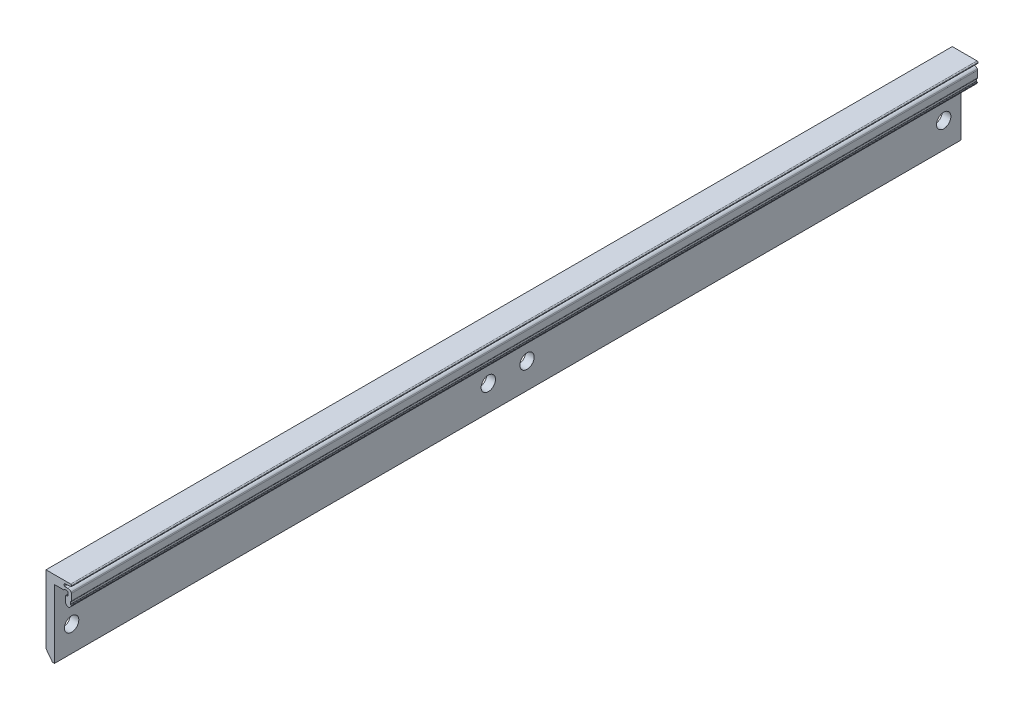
ISO-10303-21;
HEADER;
FILE_DESCRIPTION(('STEP AP214'),'2;1');
FILE_NAME('part.step','',(''),(''),'','','');
FILE_SCHEMA(('AUTOMOTIVE_DESIGN { 1 0 10303 214 1 1 1 1 }'));
ENDSEC;
DATA;
#1=APPLICATION_CONTEXT('core data for automotive mechanical design processes');
#2=APPLICATION_PROTOCOL_DEFINITION('international standard','automotive_design',2000,#1);
#3=PRODUCT_CONTEXT('',#1,'mechanical');
#4=PRODUCT('Part','Part','',(#3));
#5=PRODUCT_RELATED_PRODUCT_CATEGORY('part','',(#4));
#6=PRODUCT_DEFINITION_FORMATION('','',#4);
#7=PRODUCT_DEFINITION_CONTEXT('part definition',#1,'design');
#8=PRODUCT_DEFINITION('design','',#6,#7);
#9=PRODUCT_DEFINITION_SHAPE('','',#8);
#10=(LENGTH_UNIT() NAMED_UNIT(*) SI_UNIT(.MILLI.,.METRE.));
#11=(NAMED_UNIT(*) PLANE_ANGLE_UNIT() SI_UNIT($,.RADIAN.));
#12=(NAMED_UNIT(*) SI_UNIT($,.STERADIAN.) SOLID_ANGLE_UNIT());
#13=UNCERTAINTY_MEASURE_WITH_UNIT(LENGTH_MEASURE(1.E-05),#10,'distance_accuracy_value','');
#14=(GEOMETRIC_REPRESENTATION_CONTEXT(3) GLOBAL_UNCERTAINTY_ASSIGNED_CONTEXT((#13)) GLOBAL_UNIT_ASSIGNED_CONTEXT((#10,
#11,#12)) REPRESENTATION_CONTEXT('',''));
#15=CARTESIAN_POINT('',(0.,0.,0.));
#16=DIRECTION('',(0.,0.,1.));
#17=DIRECTION('',(1.,0.,0.));
#18=AXIS2_PLACEMENT_3D('',#15,#16,#17);
#19=CARTESIAN_POINT('',(2350.3840351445,-3290.10376988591,132.675));
#20=DIRECTION('',(0.,-1.,0.));
#21=DIRECTION('',(0.,0.,-1.));
#22=AXIS2_PLACEMENT_3D('',#19,#20,#21);
#23=PLANE('',#22);
#24=DIRECTION('',(-1.,0.,0.));
#25=VECTOR('',#24,1.);
#26=CARTESIAN_POINT('',(2350.3840351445,-3290.10376988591,-132.675));
#27=LINE('',#26,#25);
#28=CARTESIAN_POINT('',(2357.62403514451,-3290.10376988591,-132.675));
#29=VERTEX_POINT('',#28);
#30=CARTESIAN_POINT('',(2350.3840351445,-3290.10376988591,-132.675));
#31=VERTEX_POINT('',#30);
#32=EDGE_CURVE('E178',#29,#31,#27,.T.);
#33=ORIENTED_EDGE('',*,*,#32,.T.);
#34=DIRECTION('',(0.,0.,-1.));
#35=VECTOR('',#34,1.);
#36=CARTESIAN_POINT('',(2350.3840351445,-3290.10376988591,132.675));
#37=LINE('',#36,#35);
#38=CARTESIAN_POINT('',(2350.3840351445,-3290.10376988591,132.675));
#39=VERTEX_POINT('',#38);
#40=EDGE_CURVE('E11',#39,#31,#37,.T.);
#41=ORIENTED_EDGE('',*,*,#40,.F.);
#42=DIRECTION('',(-1.,0.,0.));
#43=VECTOR('',#42,1.);
#44=CARTESIAN_POINT('',(2355.38403514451,-3290.10376988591,132.675));
#45=LINE('',#44,#43);
#46=CARTESIAN_POINT('',(2357.62403514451,-3290.10376988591,132.675));
#47=VERTEX_POINT('',#46);
#48=EDGE_CURVE('E184',#47,#39,#45,.T.);
#49=ORIENTED_EDGE('',*,*,#48,.F.);
#50=DIRECTION('',(0.,0.,-1.));
#51=VECTOR('',#50,1.);
#52=CARTESIAN_POINT('',(2357.62403514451,-3290.10376988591,132.675));
#53=LINE('',#52,#51);
#54=EDGE_CURVE('E308',#47,#29,#53,.T.);
#55=ORIENTED_EDGE('',*,*,#54,.T.);
#56=EDGE_LOOP('',(#33,#41,#49,#55));
#57=FACE_BOUND('',#56,.T.);
#58=ADVANCED_FACE('F34',(#57),#23,.F.);
#59=CARTESIAN_POINT('',(2350.3840351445,-3292.60376988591,132.675));
#60=DIRECTION('',(1.,0.,0.));
#61=DIRECTION('',(0.,0.,-1.));
#62=AXIS2_PLACEMENT_3D('',#59,#60,#61);
#63=PLANE('',#62);
#64=CARTESIAN_POINT('',(2350.38403514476,-3305.10376988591,5.67500000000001));
#65=DIRECTION('',(-1.,0.,0.));
#66=DIRECTION('',(0.,-1.,0.));
#67=AXIS2_PLACEMENT_3D('',#64,#65,#66);
#68=CIRCLE('',#67,2.09999999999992);
#69=CARTESIAN_POINT('',(2350.38403514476,-3307.20376988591,5.67500000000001));
#70=VERTEX_POINT('',#69);
#71=EDGE_CURVE('E507',#70,#70,#68,.T.);
#72=ORIENTED_EDGE('',*,*,#71,.F.);
#73=EDGE_LOOP('',(#72));
#74=FACE_BOUND('',#73,.T.);
#75=CARTESIAN_POINT('',(2350.38403514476,-3305.10376988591,-5.67499999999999));
#76=DIRECTION('',(-1.,0.,0.));
#77=DIRECTION('',(0.,-1.,0.));
#78=AXIS2_PLACEMENT_3D('',#75,#76,#77);
#79=CIRCLE('',#78,2.09999999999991);
#80=CARTESIAN_POINT('',(2350.38403514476,-3307.20376988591,-5.67499999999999));
#81=VERTEX_POINT('',#80);
#82=EDGE_CURVE('E497',#81,#81,#79,.T.);
#83=ORIENTED_EDGE('',*,*,#82,.F.);
#84=EDGE_LOOP('',(#83));
#85=FACE_BOUND('',#84,.T.);
#86=CARTESIAN_POINT('',(2350.38403514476,-3305.10376988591,127.675));
#87=DIRECTION('',(-1.,0.,0.));
#88=DIRECTION('',(0.,1.,0.));
#89=AXIS2_PLACEMENT_3D('',#86,#87,#88);
#90=CIRCLE('',#89,2.09999999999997);
#91=CARTESIAN_POINT('',(2350.38403514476,-3303.00376988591,127.675));
#92=VERTEX_POINT('',#91);
#93=EDGE_CURVE('E494',#92,#92,#90,.T.);
#94=ORIENTED_EDGE('',*,*,#93,.F.);
#95=EDGE_LOOP('',(#94));
#96=FACE_BOUND('',#95,.T.);
#97=CARTESIAN_POINT('',(2350.38403514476,-3305.10376988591,-127.675));
#98=DIRECTION('',(-1.,0.,0.));
#99=DIRECTION('',(0.,-1.,0.));
#100=AXIS2_PLACEMENT_3D('',#97,#98,#99);
#101=CIRCLE('',#100,2.09999999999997);
#102=CARTESIAN_POINT('',(2350.38403514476,-3307.20376988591,-127.675));
#103=VERTEX_POINT('',#102);
#104=EDGE_CURVE('E491',#103,#103,#101,.T.);
#105=ORIENTED_EDGE('',*,*,#104,.F.);
#106=EDGE_LOOP('',(#105));
#107=FACE_BOUND('',#106,.T.);
#108=DIRECTION('',(0.,-1.,0.));
#109=VECTOR('',#108,1.);
#110=CARTESIAN_POINT('',(2350.3840351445,-3292.60376988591,-132.675));
#111=LINE('',#110,#109);
#112=CARTESIAN_POINT('',(2350.3840351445,-3310.10376988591,-132.675));
#113=VERTEX_POINT('',#112);
#114=EDGE_CURVE('E313',#31,#113,#111,.T.);
#115=ORIENTED_EDGE('',*,*,#114,.T.);
#116=DIRECTION('',(0.,0.,-1.));
#117=VECTOR('',#116,1.);
#118=CARTESIAN_POINT('',(2350.3840351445,-3310.10376988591,132.675));
#119=LINE('',#118,#117);
#120=CARTESIAN_POINT('',(2350.3840351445,-3310.10376988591,132.675));
#121=VERTEX_POINT('',#120);
#122=EDGE_CURVE('E43',#121,#113,#119,.T.);
#123=ORIENTED_EDGE('',*,*,#122,.F.);
#124=DIRECTION('',(0.,-1.,0.));
#125=VECTOR('',#124,1.);
#126=CARTESIAN_POINT('',(2350.3840351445,-3292.60376988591,132.675));
#127=LINE('',#126,#125);
#128=EDGE_CURVE('E513',#39,#121,#127,.T.);
#129=ORIENTED_EDGE('',*,*,#128,.F.);
#130=ORIENTED_EDGE('',*,*,#40,.T.);
#131=EDGE_LOOP('',(#115,#123,#129,#130));
#132=FACE_BOUND('',#131,.T.);
#133=ADVANCED_FACE('F595',(#74,#85,#96,#107,#132),#63,.F.);
#134=CARTESIAN_POINT('',(2350.3840351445,-3310.10376988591,132.675));
#135=DIRECTION('',(0.796162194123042,0.605083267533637,0.));
#136=DIRECTION('',(-0.605083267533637,0.796162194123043,0.));
#137=AXIS2_PLACEMENT_3D('',#134,#135,#136);
#138=PLANE('',#137);
#139=DIRECTION('',(0.605083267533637,-0.796162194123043,0.));
#140=VECTOR('',#139,1.);
#141=CARTESIAN_POINT('',(2350.3840351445,-3310.10376988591,-132.675));
#142=LINE('',#141,#140);
#143=CARTESIAN_POINT('',(2352.2840351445,-3312.60376988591,-132.675));
#144=VERTEX_POINT('',#143);
#145=EDGE_CURVE('E316',#113,#144,#142,.T.);
#146=ORIENTED_EDGE('',*,*,#145,.T.);
#147=DIRECTION('',(0.,0.,-1.));
#148=VECTOR('',#147,1.);
#149=CARTESIAN_POINT('',(2352.2840351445,-3312.60376988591,132.675));
#150=LINE('',#149,#148);
#151=CARTESIAN_POINT('',(2352.2840351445,-3312.60376988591,132.675));
#152=VERTEX_POINT('',#151);
#153=EDGE_CURVE('E484',#152,#144,#150,.T.);
#154=ORIENTED_EDGE('',*,*,#153,.F.);
#155=DIRECTION('',(0.605083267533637,-0.796162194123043,0.));
#156=VECTOR('',#155,1.);
#157=CARTESIAN_POINT('',(2350.3840351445,-3310.10376988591,132.675));
#158=LINE('',#157,#156);
#159=EDGE_CURVE('E515',#121,#152,#158,.T.);
#160=ORIENTED_EDGE('',*,*,#159,.F.);
#161=ORIENTED_EDGE('',*,*,#122,.T.);
#162=EDGE_LOOP('',(#146,#154,#160,#161));
#163=FACE_BOUND('',#162,.T.);
#164=ADVANCED_FACE('F601',(#163),#138,.F.);
#165=CARTESIAN_POINT('',(2352.8840351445,-3312.60376988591,132.675));
#166=DIRECTION('',(0.,1.,0.));
#167=DIRECTION('',(0.,0.,1.));
#168=AXIS2_PLACEMENT_3D('',#165,#166,#167);
#169=PLANE('',#168);
#170=DIRECTION('',(1.,0.,0.));
#171=VECTOR('',#170,1.);
#172=CARTESIAN_POINT('',(2352.8840351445,-3312.60376988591,-132.675));
#173=LINE('',#172,#171);
#174=CARTESIAN_POINT('',(2352.8840351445,-3312.60376988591,-132.675));
#175=VERTEX_POINT('',#174);
#176=EDGE_CURVE('E318',#144,#175,#173,.T.);
#177=ORIENTED_EDGE('',*,*,#176,.T.);
#178=DIRECTION('',(0.,0.,-1.));
#179=VECTOR('',#178,1.);
#180=CARTESIAN_POINT('',(2352.8840351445,-3312.60376988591,132.675));
#181=LINE('',#180,#179);
#182=CARTESIAN_POINT('',(2352.8840351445,-3312.60376988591,132.675));
#183=VERTEX_POINT('',#182);
#184=EDGE_CURVE('E481',#183,#175,#181,.T.);
#185=ORIENTED_EDGE('',*,*,#184,.F.);
#186=DIRECTION('',(1.,0.,0.));
#187=VECTOR('',#186,1.);
#188=CARTESIAN_POINT('',(2352.8840351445,-3312.60376988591,132.675));
#189=LINE('',#188,#187);
#190=EDGE_CURVE('E517',#152,#183,#189,.T.);
#191=ORIENTED_EDGE('',*,*,#190,.F.);
#192=ORIENTED_EDGE('',*,*,#153,.T.);
#193=EDGE_LOOP('',(#177,#185,#191,#192));
#194=FACE_BOUND('',#193,.T.);
#195=ADVANCED_FACE('F605',(#194),#169,.F.);
#196=CARTESIAN_POINT('',(2352.88403514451,-3292.60376988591,132.675));
#197=DIRECTION('',(-1.,0.,0.));
#198=DIRECTION('',(0.,-1.,0.));
#199=AXIS2_PLACEMENT_3D('',#196,#197,#198);
#200=PLANE('',#199);
#201=CARTESIAN_POINT('',(2352.88403514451,-3305.10376988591,5.67500000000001));
#202=DIRECTION('',(-1.,0.,0.));
#203=DIRECTION('',(0.,-1.,0.));
#204=AXIS2_PLACEMENT_3D('',#201,#202,#203);
#205=CIRCLE('',#204,2.09999999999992);
#206=CARTESIAN_POINT('',(2352.88403514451,-3307.20376988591,5.67500000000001));
#207=VERTEX_POINT('',#206);
#208=EDGE_CURVE('E37',#207,#207,#205,.T.);
#209=ORIENTED_EDGE('',*,*,#208,.T.);
#210=EDGE_LOOP('',(#209));
#211=FACE_BOUND('',#210,.T.);
#212=CARTESIAN_POINT('',(2352.88403514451,-3305.10376988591,-5.67499999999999));
#213=DIRECTION('',(-1.,0.,0.));
#214=DIRECTION('',(0.,-1.,0.));
#215=AXIS2_PLACEMENT_3D('',#212,#213,#214);
#216=CIRCLE('',#215,2.09999999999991);
#217=CARTESIAN_POINT('',(2352.88403514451,-3307.20376988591,-5.67499999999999));
#218=VERTEX_POINT('',#217);
#219=EDGE_CURVE('E495',#218,#218,#216,.T.);
#220=ORIENTED_EDGE('',*,*,#219,.T.);
#221=EDGE_LOOP('',(#220));
#222=FACE_BOUND('',#221,.T.);
#223=CARTESIAN_POINT('',(2352.88403514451,-3305.10376988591,127.675));
#224=DIRECTION('',(-1.,0.,0.));
#225=DIRECTION('',(0.,-1.,0.));
#226=AXIS2_PLACEMENT_3D('',#223,#224,#225);
#227=CIRCLE('',#226,2.09999999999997);
#228=CARTESIAN_POINT('',(2352.88403514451,-3307.20376988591,127.675));
#229=VERTEX_POINT('',#228);
#230=EDGE_CURVE('E492',#229,#229,#227,.T.);
#231=ORIENTED_EDGE('',*,*,#230,.T.);
#232=EDGE_LOOP('',(#231));
#233=FACE_BOUND('',#232,.T.);
#234=CARTESIAN_POINT('',(2352.88403514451,-3305.10376988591,-127.675));
#235=DIRECTION('',(-1.,0.,0.));
#236=DIRECTION('',(0.,-1.,0.));
#237=AXIS2_PLACEMENT_3D('',#234,#235,#236);
#238=CIRCLE('',#237,2.09999999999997);
#239=CARTESIAN_POINT('',(2352.88403514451,-3307.20376988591,-127.675));
#240=VERTEX_POINT('',#239);
#241=EDGE_CURVE('E314',#240,#240,#238,.T.);
#242=ORIENTED_EDGE('',*,*,#241,.T.);
#243=EDGE_LOOP('',(#242));
#244=FACE_BOUND('',#243,.T.);
#245=DIRECTION('',(0.,1.,0.));
#246=VECTOR('',#245,1.);
#247=CARTESIAN_POINT('',(2352.88403514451,-3292.60376988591,-132.675));
#248=LINE('',#247,#246);
#249=CARTESIAN_POINT('',(2352.88403514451,-3292.60376988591,-132.675));
#250=VERTEX_POINT('',#249);
#251=EDGE_CURVE('E320',#175,#250,#248,.T.);
#252=ORIENTED_EDGE('',*,*,#251,.T.);
#253=DIRECTION('',(0.,0.,-1.));
#254=VECTOR('',#253,1.);
#255=CARTESIAN_POINT('',(2352.88403514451,-3292.60376988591,132.675));
#256=LINE('',#255,#254);
#257=CARTESIAN_POINT('',(2352.88403514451,-3292.60376988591,132.675));
#258=VERTEX_POINT('',#257);
#259=EDGE_CURVE('E478',#258,#250,#256,.T.);
#260=ORIENTED_EDGE('',*,*,#259,.F.);
#261=DIRECTION('',(0.,1.,0.));
#262=VECTOR('',#261,1.);
#263=CARTESIAN_POINT('',(2352.88403514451,-3292.60376988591,132.675));
#264=LINE('',#263,#262);
#265=EDGE_CURVE('E519',#183,#258,#264,.T.);
#266=ORIENTED_EDGE('',*,*,#265,.F.);
#267=ORIENTED_EDGE('',*,*,#184,.T.);
#268=EDGE_LOOP('',(#252,#260,#266,#267));
#269=FACE_BOUND('',#268,.T.);
#270=ADVANCED_FACE('F610',(#211,#222,#233,#244,#269),#200,.F.);
#271=CARTESIAN_POINT('',(2355.38403514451,-3292.60376988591,132.675));
#272=DIRECTION('',(0.,1.,0.));
#273=DIRECTION('',(0.,0.,1.));
#274=AXIS2_PLACEMENT_3D('',#271,#272,#273);
#275=PLANE('',#274);
#276=DIRECTION('',(1.,0.,0.));
#277=VECTOR('',#276,1.);
#278=CARTESIAN_POINT('',(2355.38403514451,-3292.60376988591,-132.675));
#279=LINE('',#278,#277);
#280=CARTESIAN_POINT('',(2355.46834905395,-3292.60376988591,-132.675));
#281=VERTEX_POINT('',#280);
#282=EDGE_CURVE('E323',#250,#281,#279,.T.);
#283=ORIENTED_EDGE('',*,*,#282,.T.);
#284=DIRECTION('',(0.,0.,-1.));
#285=VECTOR('',#284,1.);
#286=CARTESIAN_POINT('',(2355.46834905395,-3292.60376988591,132.675));
#287=LINE('',#286,#285);
#288=CARTESIAN_POINT('',(2355.46834905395,-3292.60376988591,132.675));
#289=VERTEX_POINT('',#288);
#290=EDGE_CURVE('E475',#289,#281,#287,.T.);
#291=ORIENTED_EDGE('',*,*,#290,.F.);
#292=DIRECTION('',(1.,-3.55271367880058E-13,0.));
#293=VECTOR('',#292,1.);
#294=CARTESIAN_POINT('',(2352.88403514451,-3292.60376988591,132.675));
#295=LINE('',#294,#293);
#296=EDGE_CURVE('E521',#258,#289,#295,.T.);
#297=ORIENTED_EDGE('',*,*,#296,.F.);
#298=ORIENTED_EDGE('',*,*,#259,.T.);
#299=EDGE_LOOP('',(#283,#291,#297,#298));
#300=FACE_BOUND('',#299,.T.);
#301=ADVANCED_FACE('F616',(#300),#275,.F.);
#302=CARTESIAN_POINT('',(2355.46834905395,-3292.30376988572,132.675));
#303=DIRECTION('',(0.,0.,-1.));
#304=DIRECTION('',(-1.,0.,0.));
#305=AXIS2_PLACEMENT_3D('',#302,#303,#304);
#306=CYLINDRICAL_SURFACE('',#305,0.300000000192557);
#307=CARTESIAN_POINT('',(2355.46834905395,-3292.30376988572,-132.675));
#308=DIRECTION('',(0.,0.,1.));
#309=DIRECTION('',(-1.,0.,0.));
#310=AXIS2_PLACEMENT_3D('',#307,#308,#309);
#311=CIRCLE('',#310,0.300000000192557);
#312=CARTESIAN_POINT('',(2355.72815667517,-3292.45376988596,-132.675));
#313=VERTEX_POINT('',#312);
#314=EDGE_CURVE('E325',#281,#313,#311,.T.);
#315=ORIENTED_EDGE('',*,*,#314,.T.);
#316=DIRECTION('',(0.,0.,-1.));
#317=VECTOR('',#316,1.);
#318=CARTESIAN_POINT('',(2355.72815667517,-3292.45376988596,132.675));
#319=LINE('',#318,#317);
#320=CARTESIAN_POINT('',(2355.72815667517,-3292.45376988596,132.675));
#321=VERTEX_POINT('',#320);
#322=EDGE_CURVE('E472',#321,#313,#319,.T.);
#323=ORIENTED_EDGE('',*,*,#322,.F.);
#324=CARTESIAN_POINT('',(2355.46834905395,-3292.30376988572,132.675));
#325=DIRECTION('',(0.,0.,1.));
#326=DIRECTION('',(-1.,0.,0.));
#327=AXIS2_PLACEMENT_3D('',#324,#325,#326);
#328=CIRCLE('',#327,0.300000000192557);
#329=EDGE_CURVE('E523',#289,#321,#328,.T.);
#330=ORIENTED_EDGE('',*,*,#329,.F.);
#331=ORIENTED_EDGE('',*,*,#290,.T.);
#332=EDGE_LOOP('',(#315,#323,#330,#331));
#333=FACE_BOUND('',#332,.T.);
#334=ADVANCED_FACE('F619',(#333),#306,.T.);
#335=CARTESIAN_POINT('',(2355.9879642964,-3292.60376988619,132.675));
#336=DIRECTION('',(0.,0.,-1.));
#337=DIRECTION('',(-1.,0.,0.));
#338=AXIS2_PLACEMENT_3D('',#335,#336,#337);
#339=CYLINDRICAL_SURFACE('',#338,0.300000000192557);
#340=CARTESIAN_POINT('',(2355.9879642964,-3292.60376988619,-132.675));
#341=DIRECTION('',(0.,0.,-1.));
#342=DIRECTION('',(-1.,0.,0.));
#343=AXIS2_PLACEMENT_3D('',#340,#341,#342);
#344=CIRCLE('',#343,0.300000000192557);
#345=CARTESIAN_POINT('',(2355.9879642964,-3292.303769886,-132.675));
#346=VERTEX_POINT('',#345);
#347=EDGE_CURVE('E327',#313,#346,#344,.T.);
#348=ORIENTED_EDGE('',*,*,#347,.T.);
#349=DIRECTION('',(0.,0.,-1.));
#350=VECTOR('',#349,1.);
#351=CARTESIAN_POINT('',(2355.9879642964,-3292.303769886,132.675));
#352=LINE('',#351,#350);
#353=CARTESIAN_POINT('',(2355.9879642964,-3292.303769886,132.675));
#354=VERTEX_POINT('',#353);
#355=EDGE_CURVE('E469',#354,#346,#352,.T.);
#356=ORIENTED_EDGE('',*,*,#355,.F.);
#357=CARTESIAN_POINT('',(2355.9879642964,-3292.60376988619,132.675));
#358=DIRECTION('',(0.,0.,-1.));
#359=DIRECTION('',(-1.,0.,0.));
#360=AXIS2_PLACEMENT_3D('',#357,#358,#359);
#361=CIRCLE('',#360,0.300000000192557);
#362=EDGE_CURVE('E525',#321,#354,#361,.T.);
#363=ORIENTED_EDGE('',*,*,#362,.F.);
#364=ORIENTED_EDGE('',*,*,#322,.T.);
#365=EDGE_LOOP('',(#348,#356,#363,#364));
#366=FACE_BOUND('',#365,.T.);
#367=ADVANCED_FACE('F624',(#366),#339,.F.);
#368=CARTESIAN_POINT('',(2356.52403514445,-3292.303769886,132.675));
#369=DIRECTION('',(0.,1.,0.));
#370=DIRECTION('',(0.,0.,1.));
#371=AXIS2_PLACEMENT_3D('',#368,#369,#370);
#372=PLANE('',#371);
#373=DIRECTION('',(1.,0.,0.));
#374=VECTOR('',#373,1.);
#375=CARTESIAN_POINT('',(2356.52403514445,-3292.303769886,-132.675));
#376=LINE('',#375,#374);
#377=CARTESIAN_POINT('',(2356.52403514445,-3292.303769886,-132.675));
#378=VERTEX_POINT('',#377);
#379=EDGE_CURVE('E329',#346,#378,#376,.T.);
#380=ORIENTED_EDGE('',*,*,#379,.T.);
#381=DIRECTION('',(0.,0.,-1.));
#382=VECTOR('',#381,1.);
#383=CARTESIAN_POINT('',(2356.52403514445,-3292.303769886,132.675));
#384=LINE('',#383,#382);
#385=CARTESIAN_POINT('',(2356.52403514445,-3292.303769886,132.675));
#386=VERTEX_POINT('',#385);
#387=EDGE_CURVE('E466',#386,#378,#384,.T.);
#388=ORIENTED_EDGE('',*,*,#387,.F.);
#389=DIRECTION('',(1.,0.,0.));
#390=VECTOR('',#389,1.);
#391=CARTESIAN_POINT('',(2356.52403514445,-3292.303769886,132.675));
#392=LINE('',#391,#390);
#393=EDGE_CURVE('E527',#354,#386,#392,.T.);
#394=ORIENTED_EDGE('',*,*,#393,.F.);
#395=ORIENTED_EDGE('',*,*,#355,.T.);
#396=EDGE_LOOP('',(#380,#388,#394,#395));
#397=FACE_BOUND('',#396,.T.);
#398=ADVANCED_FACE('F630',(#397),#372,.F.);
#399=CARTESIAN_POINT('',(2356.52403514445,-3292.603769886,132.675));
#400=DIRECTION('',(0.,0.,-1.));
#401=DIRECTION('',(-1.,0.,0.));
#402=AXIS2_PLACEMENT_3D('',#399,#400,#401);
#403=CYLINDRICAL_SURFACE('',#402,0.300000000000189);
#404=CARTESIAN_POINT('',(2356.52403514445,-3292.603769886,-132.675));
#405=DIRECTION('',(0.,0.,-1.));
#406=DIRECTION('',(-1.,0.,0.));
#407=AXIS2_PLACEMENT_3D('',#404,#405,#406);
#408=CIRCLE('',#407,0.300000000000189);
#409=CARTESIAN_POINT('',(2356.82403514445,-3292.603769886,-132.675));
#410=VERTEX_POINT('',#409);
#411=EDGE_CURVE('E331',#378,#410,#408,.T.);
#412=ORIENTED_EDGE('',*,*,#411,.T.);
#413=DIRECTION('',(0.,0.,-1.));
#414=VECTOR('',#413,1.);
#415=CARTESIAN_POINT('',(2356.82403514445,-3292.603769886,132.675));
#416=LINE('',#415,#414);
#417=CARTESIAN_POINT('',(2356.82403514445,-3292.603769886,132.675));
#418=VERTEX_POINT('',#417);
#419=EDGE_CURVE('E463',#418,#410,#416,.T.);
#420=ORIENTED_EDGE('',*,*,#419,.F.);
#421=CARTESIAN_POINT('',(2356.52403514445,-3292.603769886,132.675));
#422=DIRECTION('',(0.,0.,-1.));
#423=DIRECTION('',(-1.,0.,0.));
#424=AXIS2_PLACEMENT_3D('',#421,#422,#423);
#425=CIRCLE('',#424,0.300000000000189);
#426=EDGE_CURVE('E529',#386,#418,#425,.T.);
#427=ORIENTED_EDGE('',*,*,#426,.F.);
#428=ORIENTED_EDGE('',*,*,#387,.T.);
#429=EDGE_LOOP('',(#412,#420,#427,#428));
#430=FACE_BOUND('',#429,.T.);
#431=ADVANCED_FACE('F634',(#430),#403,.F.);
#432=CARTESIAN_POINT('',(2356.82403514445,-3293.40376988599,132.675));
#433=DIRECTION('',(1.,0.,0.));
#434=DIRECTION('',(0.,0.,-1.));
#435=AXIS2_PLACEMENT_3D('',#432,#433,#434);
#436=PLANE('',#435);
#437=DIRECTION('',(0.,-1.,0.));
#438=VECTOR('',#437,1.);
#439=CARTESIAN_POINT('',(2356.82403514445,-3293.40376988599,-132.675));
#440=LINE('',#439,#438);
#441=CARTESIAN_POINT('',(2356.82403514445,-3293.40376988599,-132.675));
#442=VERTEX_POINT('',#441);
#443=EDGE_CURVE('E333',#410,#442,#440,.T.);
#444=ORIENTED_EDGE('',*,*,#443,.T.);
#445=DIRECTION('',(0.,0.,-1.));
#446=VECTOR('',#445,1.);
#447=CARTESIAN_POINT('',(2356.82403514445,-3293.40376988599,132.675));
#448=LINE('',#447,#446);
#449=CARTESIAN_POINT('',(2356.82403514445,-3293.40376988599,132.675));
#450=VERTEX_POINT('',#449);
#451=EDGE_CURVE('E460',#450,#442,#448,.T.);
#452=ORIENTED_EDGE('',*,*,#451,.F.);
#453=DIRECTION('',(0.,-1.,0.));
#454=VECTOR('',#453,1.);
#455=CARTESIAN_POINT('',(2356.82403514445,-3293.40376988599,132.675));
#456=LINE('',#455,#454);
#457=EDGE_CURVE('E531',#418,#450,#456,.T.);
#458=ORIENTED_EDGE('',*,*,#457,.F.);
#459=ORIENTED_EDGE('',*,*,#419,.T.);
#460=EDGE_LOOP('',(#444,#452,#458,#459));
#461=FACE_BOUND('',#460,.T.);
#462=ADVANCED_FACE('F639',(#461),#436,.F.);
#463=CARTESIAN_POINT('',(2356.52403514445,-3293.40376988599,132.675));
#464=DIRECTION('',(0.,0.,-1.));
#465=DIRECTION('',(-1.,0.,0.));
#466=AXIS2_PLACEMENT_3D('',#463,#464,#465);
#467=CYLINDRICAL_SURFACE('',#466,0.300000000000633);
#468=CARTESIAN_POINT('',(2356.52403514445,-3293.40376988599,-132.675));
#469=DIRECTION('',(0.,0.,-1.));
#470=DIRECTION('',(-1.,0.,0.));
#471=AXIS2_PLACEMENT_3D('',#468,#469,#470);
#472=CIRCLE('',#471,0.300000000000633);
#473=CARTESIAN_POINT('',(2356.52403514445,-3293.70376988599,-132.675));
#474=VERTEX_POINT('',#473);
#475=EDGE_CURVE('E335',#442,#474,#472,.T.);
#476=ORIENTED_EDGE('',*,*,#475,.T.);
#477=DIRECTION('',(0.,0.,-1.));
#478=VECTOR('',#477,1.);
#479=CARTESIAN_POINT('',(2356.52403514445,-3293.70376988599,132.675));
#480=LINE('',#479,#478);
#481=CARTESIAN_POINT('',(2356.52403514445,-3293.70376988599,132.675));
#482=VERTEX_POINT('',#481);
#483=EDGE_CURVE('E457',#482,#474,#480,.T.);
#484=ORIENTED_EDGE('',*,*,#483,.F.);
#485=CARTESIAN_POINT('',(2356.52403514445,-3293.40376988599,132.675));
#486=DIRECTION('',(0.,0.,-1.));
#487=DIRECTION('',(-1.,0.,0.));
#488=AXIS2_PLACEMENT_3D('',#485,#486,#487);
#489=CIRCLE('',#488,0.300000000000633);
#490=EDGE_CURVE('E533',#450,#482,#489,.T.);
#491=ORIENTED_EDGE('',*,*,#490,.F.);
#492=ORIENTED_EDGE('',*,*,#451,.T.);
#493=EDGE_LOOP('',(#476,#484,#491,#492));
#494=FACE_BOUND('',#493,.T.);
#495=ADVANCED_FACE('F645',(#494),#467,.F.);
#496=CARTESIAN_POINT('',(2356.32403514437,-3293.70376988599,132.675));
#497=DIRECTION('',(0.,-1.,0.));
#498=DIRECTION('',(0.,0.,-1.));
#499=AXIS2_PLACEMENT_3D('',#496,#497,#498);
#500=PLANE('',#499);
#501=DIRECTION('',(-1.,0.,0.));
#502=VECTOR('',#501,1.);
#503=CARTESIAN_POINT('',(2356.32403514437,-3293.70376988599,-132.675));
#504=LINE('',#503,#502);
#505=CARTESIAN_POINT('',(2356.32403514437,-3293.70376988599,-132.675));
#506=VERTEX_POINT('',#505);
#507=EDGE_CURVE('E337',#474,#506,#504,.T.);
#508=ORIENTED_EDGE('',*,*,#507,.T.);
#509=DIRECTION('',(0.,0.,-1.));
#510=VECTOR('',#509,1.);
#511=CARTESIAN_POINT('',(2356.32403514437,-3293.70376988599,132.675));
#512=LINE('',#511,#510);
#513=CARTESIAN_POINT('',(2356.32403514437,-3293.70376988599,132.675));
#514=VERTEX_POINT('',#513);
#515=EDGE_CURVE('E454',#514,#506,#512,.T.);
#516=ORIENTED_EDGE('',*,*,#515,.F.);
#517=DIRECTION('',(-1.,0.,0.));
#518=VECTOR('',#517,1.);
#519=CARTESIAN_POINT('',(2356.32403514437,-3293.70376988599,132.675));
#520=LINE('',#519,#518);
#521=EDGE_CURVE('E535',#482,#514,#520,.T.);
#522=ORIENTED_EDGE('',*,*,#521,.F.);
#523=ORIENTED_EDGE('',*,*,#483,.T.);
#524=EDGE_LOOP('',(#508,#516,#522,#523));
#525=FACE_BOUND('',#524,.T.);
#526=ADVANCED_FACE('F649',(#525),#500,.F.);
#527=CARTESIAN_POINT('',(2356.32403514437,-3294.003769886,132.675));
#528=DIRECTION('',(0.,0.,-1.));
#529=DIRECTION('',(-1.,0.,0.));
#530=AXIS2_PLACEMENT_3D('',#527,#528,#529);
#531=CYLINDRICAL_SURFACE('',#530,0.300000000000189);
#532=CARTESIAN_POINT('',(2356.32403514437,-3294.003769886,-132.675));
#533=DIRECTION('',(0.,0.,1.));
#534=DIRECTION('',(-1.,0.,0.));
#535=AXIS2_PLACEMENT_3D('',#532,#533,#534);
#536=CIRCLE('',#535,0.300000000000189);
#537=CARTESIAN_POINT('',(2356.02403514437,-3294.003769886,-132.675));
#538=VERTEX_POINT('',#537);
#539=EDGE_CURVE('E339',#506,#538,#536,.T.);
#540=ORIENTED_EDGE('',*,*,#539,.T.);
#541=DIRECTION('',(0.,0.,-1.));
#542=VECTOR('',#541,1.);
#543=CARTESIAN_POINT('',(2356.02403514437,-3294.003769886,132.675));
#544=LINE('',#543,#542);
#545=CARTESIAN_POINT('',(2356.02403514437,-3294.003769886,132.675));
#546=VERTEX_POINT('',#545);
#547=EDGE_CURVE('E451',#546,#538,#544,.T.);
#548=ORIENTED_EDGE('',*,*,#547,.F.);
#549=CARTESIAN_POINT('',(2356.32403514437,-3294.003769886,132.675));
#550=DIRECTION('',(0.,0.,1.));
#551=DIRECTION('',(-1.,0.,0.));
#552=AXIS2_PLACEMENT_3D('',#549,#550,#551);
#553=CIRCLE('',#552,0.300000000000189);
#554=EDGE_CURVE('E537',#514,#546,#553,.T.);
#555=ORIENTED_EDGE('',*,*,#554,.F.);
#556=ORIENTED_EDGE('',*,*,#515,.T.);
#557=EDGE_LOOP('',(#540,#548,#555,#556));
#558=FACE_BOUND('',#557,.T.);
#559=ADVANCED_FACE('F654',(#558),#531,.T.);
#560=CARTESIAN_POINT('',(2356.02403514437,-3295.45454467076,132.675));
#561=DIRECTION('',(1.,3.06104858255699E-13,0.));
#562=DIRECTION('',(-3.06104858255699E-13,1.,0.));
#563=AXIS2_PLACEMENT_3D('',#560,#561,#562);
#564=PLANE('',#563);
#565=DIRECTION('',(3.06104858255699E-13,-1.,0.));
#566=VECTOR('',#565,1.);
#567=CARTESIAN_POINT('',(2356.02403514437,-3295.45454467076,-132.675));
#568=LINE('',#567,#566);
#569=CARTESIAN_POINT('',(2356.02403514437,-3295.45454467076,-132.675));
#570=VERTEX_POINT('',#569);
#571=EDGE_CURVE('E341',#538,#570,#568,.T.);
#572=ORIENTED_EDGE('',*,*,#571,.T.);
#573=DIRECTION('',(0.,0.,-1.));
#574=VECTOR('',#573,1.);
#575=CARTESIAN_POINT('',(2356.02403514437,-3295.45454467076,132.675));
#576=LINE('',#575,#574);
#577=CARTESIAN_POINT('',(2356.02403514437,-3295.45454467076,132.675));
#578=VERTEX_POINT('',#577);
#579=EDGE_CURVE('E448',#578,#570,#576,.T.);
#580=ORIENTED_EDGE('',*,*,#579,.F.);
#581=DIRECTION('',(3.06104858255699E-13,-1.,0.));
#582=VECTOR('',#581,1.);
#583=CARTESIAN_POINT('',(2356.02403514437,-3295.45454467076,132.675));
#584=LINE('',#583,#582);
#585=EDGE_CURVE('E539',#546,#578,#584,.T.);
#586=ORIENTED_EDGE('',*,*,#585,.F.);
#587=ORIENTED_EDGE('',*,*,#547,.T.);
#588=EDGE_LOOP('',(#572,#580,#586,#587));
#589=FACE_BOUND('',#588,.T.);
#590=ADVANCED_FACE('F660',(#589),#564,.F.);
#591=CARTESIAN_POINT('',(2356.3240351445,-3295.45454467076,132.675));
#592=DIRECTION('',(0.,0.,-1.));
#593=DIRECTION('',(-1.,0.,0.));
#594=AXIS2_PLACEMENT_3D('',#591,#592,#593);
#595=CYLINDRICAL_SURFACE('',#594,0.300000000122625);
#596=CARTESIAN_POINT('',(2356.3240351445,-3295.45454467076,-132.675));
#597=DIRECTION('',(0.,0.,1.));
#598=DIRECTION('',(-1.,0.,0.));
#599=AXIS2_PLACEMENT_3D('',#596,#597,#598);
#600=CIRCLE('',#599,0.300000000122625);
#601=CARTESIAN_POINT('',(2356.09426057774,-3295.64742714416,-132.675));
#602=VERTEX_POINT('',#601);
#603=EDGE_CURVE('E343',#570,#602,#600,.T.);
#604=ORIENTED_EDGE('',*,*,#603,.T.);
#605=DIRECTION('',(0.,0.,-1.));
#606=VECTOR('',#605,1.);
#607=CARTESIAN_POINT('',(2356.09426057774,-3295.64742714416,132.675));
#608=LINE('',#607,#606);
#609=CARTESIAN_POINT('',(2356.09426057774,-3295.64742714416,132.675));
#610=VERTEX_POINT('',#609);
#611=EDGE_CURVE('E445',#610,#602,#608,.T.);
#612=ORIENTED_EDGE('',*,*,#611,.F.);
#613=CARTESIAN_POINT('',(2356.3240351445,-3295.45454467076,132.675));
#614=DIRECTION('',(0.,0.,1.));
#615=DIRECTION('',(-1.,0.,0.));
#616=AXIS2_PLACEMENT_3D('',#613,#614,#615);
#617=CIRCLE('',#616,0.300000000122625);
#618=EDGE_CURVE('E541',#578,#610,#617,.T.);
#619=ORIENTED_EDGE('',*,*,#618,.F.);
#620=ORIENTED_EDGE('',*,*,#579,.T.);
#621=EDGE_LOOP('',(#604,#612,#619,#620));
#622=FACE_BOUND('',#621,.T.);
#623=ADVANCED_FACE('F664',(#622),#595,.T.);
#624=CARTESIAN_POINT('',(2356.46501305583,-3296.08909241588,132.675));
#625=DIRECTION('',(0.765915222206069,0.642941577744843,0.));
#626=DIRECTION('',(-0.642941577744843,0.765915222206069,0.));
#627=AXIS2_PLACEMENT_3D('',#624,#625,#626);
#628=PLANE('',#627);
#629=DIRECTION('',(0.642941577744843,-0.765915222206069,0.));
#630=VECTOR('',#629,1.);
#631=CARTESIAN_POINT('',(2356.46501305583,-3296.08909241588,-132.675));
#632=LINE('',#631,#630);
#633=CARTESIAN_POINT('',(2356.46501305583,-3296.08909241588,-132.675));
#634=VERTEX_POINT('',#633);
#635=EDGE_CURVE('E345',#602,#634,#632,.T.);
#636=ORIENTED_EDGE('',*,*,#635,.T.);
#637=DIRECTION('',(0.,0.,-1.));
#638=VECTOR('',#637,1.);
#639=CARTESIAN_POINT('',(2356.46501305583,-3296.08909241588,132.675));
#640=LINE('',#639,#638);
#641=CARTESIAN_POINT('',(2356.46501305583,-3296.08909241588,132.675));
#642=VERTEX_POINT('',#641);
#643=EDGE_CURVE('E442',#642,#634,#640,.T.);
#644=ORIENTED_EDGE('',*,*,#643,.F.);
#645=DIRECTION('',(0.642941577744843,-0.765915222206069,0.));
#646=VECTOR('',#645,1.);
#647=CARTESIAN_POINT('',(2356.46501305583,-3296.08909241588,132.675));
#648=LINE('',#647,#646);
#649=EDGE_CURVE('E543',#610,#642,#648,.T.);
#650=ORIENTED_EDGE('',*,*,#649,.F.);
#651=ORIENTED_EDGE('',*,*,#611,.T.);
#652=EDGE_LOOP('',(#636,#644,#650,#651));
#653=FACE_BOUND('',#652,.T.);
#654=ADVANCED_FACE('F669',(#653),#628,.F.);
#655=CARTESIAN_POINT('',(2356.92403515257,-3295.703769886,132.675));
#656=DIRECTION('',(0.,0.,-1.));
#657=DIRECTION('',(-1.,0.,0.));
#658=AXIS2_PLACEMENT_3D('',#655,#656,#657);
#659=CYLINDRICAL_SURFACE('',#658,0.599311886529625);
#660=CARTESIAN_POINT('',(2356.92403515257,-3295.703769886,-132.675));
#661=DIRECTION('',(0.,0.,1.));
#662=DIRECTION('',(-1.,0.,0.));
#663=AXIS2_PLACEMENT_3D('',#660,#661,#662);
#664=CIRCLE('',#663,0.599311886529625);
#665=CARTESIAN_POINT('',(2357.38305725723,-3296.08909240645,-132.675));
#666=VERTEX_POINT('',#665);
#667=EDGE_CURVE('E347',#634,#666,#664,.T.);
#668=ORIENTED_EDGE('',*,*,#667,.T.);
#669=DIRECTION('',(0.,0.,-1.));
#670=VECTOR('',#669,1.);
#671=CARTESIAN_POINT('',(2357.38305725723,-3296.08909240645,132.675));
#672=LINE('',#671,#670);
#673=CARTESIAN_POINT('',(2357.38305725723,-3296.08909240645,132.675));
#674=VERTEX_POINT('',#673);
#675=EDGE_CURVE('E439',#674,#666,#672,.T.);
#676=ORIENTED_EDGE('',*,*,#675,.F.);
#677=CARTESIAN_POINT('',(2356.92403515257,-3295.703769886,132.675));
#678=DIRECTION('',(0.,0.,1.));
#679=DIRECTION('',(-1.,0.,0.));
#680=AXIS2_PLACEMENT_3D('',#677,#678,#679);
#681=CIRCLE('',#680,0.599311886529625);
#682=EDGE_CURVE('E545',#642,#674,#681,.T.);
#683=ORIENTED_EDGE('',*,*,#682,.F.);
#684=ORIENTED_EDGE('',*,*,#643,.T.);
#685=EDGE_LOOP('',(#668,#676,#683,#684));
#686=FACE_BOUND('',#685,.T.);
#687=ADVANCED_FACE('F675',(#686),#659,.T.);
#688=CARTESIAN_POINT('',(2357.80062666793,-3295.59165563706,132.675));
#689=DIRECTION('',(-0.765915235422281,0.642941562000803,0.));
#690=DIRECTION('',(-0.642941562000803,-0.765915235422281,0.));
#691=AXIS2_PLACEMENT_3D('',#688,#689,#690);
#692=PLANE('',#691);
#693=DIRECTION('',(0.642941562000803,0.765915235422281,0.));
#694=VECTOR('',#693,1.);
#695=CARTESIAN_POINT('',(2357.80062666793,-3295.59165563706,-132.675));
#696=LINE('',#695,#694);
#697=CARTESIAN_POINT('',(2357.80062666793,-3295.59165563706,-132.675));
#698=VERTEX_POINT('',#697);
#699=EDGE_CURVE('E349',#666,#698,#696,.T.);
#700=ORIENTED_EDGE('',*,*,#699,.T.);
#701=DIRECTION('',(0.,0.,-1.));
#702=VECTOR('',#701,1.);
#703=CARTESIAN_POINT('',(2357.80062666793,-3295.59165563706,132.675));
#704=LINE('',#703,#702);
#705=CARTESIAN_POINT('',(2357.80062666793,-3295.59165563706,132.675));
#706=VERTEX_POINT('',#705);
#707=EDGE_CURVE('E436',#706,#698,#704,.T.);
#708=ORIENTED_EDGE('',*,*,#707,.F.);
#709=DIRECTION('',(0.642941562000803,0.765915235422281,0.));
#710=VECTOR('',#709,1.);
#711=CARTESIAN_POINT('',(2357.80062666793,-3295.59165563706,132.675));
#712=LINE('',#711,#710);
#713=EDGE_CURVE('E547',#674,#706,#712,.T.);
#714=ORIENTED_EDGE('',*,*,#713,.F.);
#715=ORIENTED_EDGE('',*,*,#675,.T.);
#716=EDGE_LOOP('',(#700,#708,#714,#715));
#717=FACE_BOUND('',#716,.T.);
#718=ADVANCED_FACE('F679',(#717),#692,.F.);
#719=CARTESIAN_POINT('',(2357.7240351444,-3295.52736148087,132.675));
#720=DIRECTION('',(0.,0.,-1.));
#721=DIRECTION('',(-1.,0.,0.));
#722=AXIS2_PLACEMENT_3D('',#719,#720,#721);
#723=CYLINDRICAL_SURFACE('',#722,0.0999999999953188);
#724=CARTESIAN_POINT('',(2357.7240351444,-3295.52736148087,-132.675));
#725=DIRECTION('',(0.,0.,1.));
#726=DIRECTION('',(-1.,0.,0.));
#727=AXIS2_PLACEMENT_3D('',#724,#725,#726);
#728=CIRCLE('',#727,0.0999999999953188);
#729=CARTESIAN_POINT('',(2357.82403514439,-3295.52736148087,-132.675));
#730=VERTEX_POINT('',#729);
#731=EDGE_CURVE('E351',#698,#730,#728,.T.);
#732=ORIENTED_EDGE('',*,*,#731,.T.);
#733=DIRECTION('',(0.,0.,-1.));
#734=VECTOR('',#733,1.);
#735=CARTESIAN_POINT('',(2357.82403514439,-3295.52736148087,132.675));
#736=LINE('',#735,#734);
#737=CARTESIAN_POINT('',(2357.82403514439,-3295.52736148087,132.675));
#738=VERTEX_POINT('',#737);
#739=EDGE_CURVE('E433',#738,#730,#736,.T.);
#740=ORIENTED_EDGE('',*,*,#739,.F.);
#741=CARTESIAN_POINT('',(2357.7240351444,-3295.52736148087,132.675));
#742=DIRECTION('',(0.,0.,1.));
#743=DIRECTION('',(-1.,0.,0.));
#744=AXIS2_PLACEMENT_3D('',#741,#742,#743);
#745=CIRCLE('',#744,0.0999999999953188);
#746=EDGE_CURVE('E549',#706,#738,#745,.T.);
#747=ORIENTED_EDGE('',*,*,#746,.F.);
#748=ORIENTED_EDGE('',*,*,#707,.T.);
#749=EDGE_LOOP('',(#732,#740,#747,#748));
#750=FACE_BOUND('',#749,.T.);
#751=ADVANCED_FACE('F684',(#750),#723,.T.);
#752=CARTESIAN_POINT('',(2357.82403514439,-3295.50795991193,132.675));
#753=DIRECTION('',(-1.,0.,0.));
#754=DIRECTION('',(0.,0.,1.));
#755=AXIS2_PLACEMENT_3D('',#752,#753,#754);
#756=PLANE('',#755);
#757=DIRECTION('',(0.,1.,0.));
#758=VECTOR('',#757,1.);
#759=CARTESIAN_POINT('',(2357.82403514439,-3295.50795991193,-132.675));
#760=LINE('',#759,#758);
#761=CARTESIAN_POINT('',(2357.82403514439,-3295.50795991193,-132.675));
#762=VERTEX_POINT('',#761);
#763=EDGE_CURVE('E353',#730,#762,#760,.T.);
#764=ORIENTED_EDGE('',*,*,#763,.T.);
#765=DIRECTION('',(0.,0.,-1.));
#766=VECTOR('',#765,1.);
#767=CARTESIAN_POINT('',(2357.82403514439,-3295.50795991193,132.675));
#768=LINE('',#767,#766);
#769=CARTESIAN_POINT('',(2357.82403514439,-3295.50795991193,132.675));
#770=VERTEX_POINT('',#769);
#771=EDGE_CURVE('E430',#770,#762,#768,.T.);
#772=ORIENTED_EDGE('',*,*,#771,.F.);
#773=DIRECTION('',(0.,1.,0.));
#774=VECTOR('',#773,1.);
#775=CARTESIAN_POINT('',(2357.82403514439,-3295.50795991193,132.675));
#776=LINE('',#775,#774);
#777=EDGE_CURVE('E551',#738,#770,#776,.T.);
#778=ORIENTED_EDGE('',*,*,#777,.F.);
#779=ORIENTED_EDGE('',*,*,#739,.T.);
#780=EDGE_LOOP('',(#764,#772,#778,#779));
#781=FACE_BOUND('',#780,.T.);
#782=ADVANCED_FACE('F690',(#781),#756,.F.);
#783=CARTESIAN_POINT('',(2357.72403514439,-3295.50795991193,132.675));
#784=DIRECTION('',(0.,0.,-1.));
#785=DIRECTION('',(-1.,0.,0.));
#786=AXIS2_PLACEMENT_3D('',#783,#784,#785);
#787=CYLINDRICAL_SURFACE('',#786,0.0999999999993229);
#788=CARTESIAN_POINT('',(2357.72403514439,-3295.50795991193,-132.675));
#789=DIRECTION('',(0.,0.,1.));
#790=DIRECTION('',(-1.,0.,0.));
#791=AXIS2_PLACEMENT_3D('',#788,#789,#790);
#792=CIRCLE('',#791,0.0999999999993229);
#793=CARTESIAN_POINT('',(2357.72403514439,-3295.40795991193,-132.675));
#794=VERTEX_POINT('',#793);
#795=EDGE_CURVE('E355',#762,#794,#792,.T.);
#796=ORIENTED_EDGE('',*,*,#795,.T.);
#797=DIRECTION('',(0.,0.,-1.));
#798=VECTOR('',#797,1.);
#799=CARTESIAN_POINT('',(2357.72403514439,-3295.40795991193,132.675));
#800=LINE('',#799,#798);
#801=CARTESIAN_POINT('',(2357.72403514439,-3295.40795991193,132.675));
#802=VERTEX_POINT('',#801);
#803=EDGE_CURVE('E427',#802,#794,#800,.T.);
#804=ORIENTED_EDGE('',*,*,#803,.F.);
#805=CARTESIAN_POINT('',(2357.72403514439,-3295.50795991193,132.675));
#806=DIRECTION('',(0.,0.,1.));
#807=DIRECTION('',(-1.,0.,0.));
#808=AXIS2_PLACEMENT_3D('',#805,#806,#807);
#809=CIRCLE('',#808,0.0999999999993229);
#810=EDGE_CURVE('E553',#770,#802,#809,.T.);
#811=ORIENTED_EDGE('',*,*,#810,.F.);
#812=ORIENTED_EDGE('',*,*,#771,.T.);
#813=EDGE_LOOP('',(#796,#804,#811,#812));
#814=FACE_BOUND('',#813,.T.);
#815=ADVANCED_FACE('F694',(#814),#787,.T.);
#816=CARTESIAN_POINT('',(2357.59724022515,-3295.40795991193,132.675));
#817=DIRECTION('',(0.,-1.,0.));
#818=DIRECTION('',(0.,0.,-1.));
#819=AXIS2_PLACEMENT_3D('',#816,#817,#818);
#820=PLANE('',#819);
#821=DIRECTION('',(-1.,0.,0.));
#822=VECTOR('',#821,1.);
#823=CARTESIAN_POINT('',(2357.59724022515,-3295.40795991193,-132.675));
#824=LINE('',#823,#822);
#825=CARTESIAN_POINT('',(2357.59724022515,-3295.40795991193,-132.675));
#826=VERTEX_POINT('',#825);
#827=EDGE_CURVE('E357',#794,#826,#824,.T.);
#828=ORIENTED_EDGE('',*,*,#827,.T.);
#829=DIRECTION('',(0.,0.,-1.));
#830=VECTOR('',#829,1.);
#831=CARTESIAN_POINT('',(2357.59724022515,-3295.40795991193,132.675));
#832=LINE('',#831,#830);
#833=CARTESIAN_POINT('',(2357.59724022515,-3295.40795991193,132.675));
#834=VERTEX_POINT('',#833);
#835=EDGE_CURVE('E424',#834,#826,#832,.T.);
#836=ORIENTED_EDGE('',*,*,#835,.F.);
#837=DIRECTION('',(-1.,0.,0.));
#838=VECTOR('',#837,1.);
#839=CARTESIAN_POINT('',(2357.59724022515,-3295.40795991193,132.675));
#840=LINE('',#839,#838);
#841=EDGE_CURVE('E555',#802,#834,#840,.T.);
#842=ORIENTED_EDGE('',*,*,#841,.F.);
#843=ORIENTED_EDGE('',*,*,#803,.T.);
#844=EDGE_LOOP('',(#828,#836,#842,#843));
#845=FACE_BOUND('',#844,.T.);
#846=ADVANCED_FACE('F699',(#845),#820,.F.);
#847=CARTESIAN_POINT('',(2357.59724022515,-3295.30795991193,132.675));
#848=DIRECTION('',(0.,0.,-1.));
#849=DIRECTION('',(-1.,0.,0.));
#850=AXIS2_PLACEMENT_3D('',#847,#848,#849);
#851=CYLINDRICAL_SURFACE('',#850,0.0999999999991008);
#852=CARTESIAN_POINT('',(2357.59724022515,-3295.30795991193,-132.675));
#853=DIRECTION('',(0.,0.,-1.));
#854=DIRECTION('',(-1.,0.,0.));
#855=AXIS2_PLACEMENT_3D('',#852,#853,#854);
#856=CIRCLE('',#855,0.0999999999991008);
#857=CARTESIAN_POINT('',(2357.49724022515,-3295.30795991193,-132.675));
#858=VERTEX_POINT('',#857);
#859=EDGE_CURVE('E359',#826,#858,#856,.T.);
#860=ORIENTED_EDGE('',*,*,#859,.T.);
#861=DIRECTION('',(0.,0.,-1.));
#862=VECTOR('',#861,1.);
#863=CARTESIAN_POINT('',(2357.49724022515,-3295.30795991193,132.675));
#864=LINE('',#863,#862);
#865=CARTESIAN_POINT('',(2357.49724022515,-3295.30795991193,132.675));
#866=VERTEX_POINT('',#865);
#867=EDGE_CURVE('E421',#866,#858,#864,.T.);
#868=ORIENTED_EDGE('',*,*,#867,.F.);
#869=CARTESIAN_POINT('',(2357.59724022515,-3295.30795991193,132.675));
#870=DIRECTION('',(0.,0.,-1.));
#871=DIRECTION('',(-1.,0.,0.));
#872=AXIS2_PLACEMENT_3D('',#869,#870,#871);
#873=CIRCLE('',#872,0.0999999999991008);
#874=EDGE_CURVE('E557',#834,#866,#873,.T.);
#875=ORIENTED_EDGE('',*,*,#874,.F.);
#876=ORIENTED_EDGE('',*,*,#835,.T.);
#877=EDGE_LOOP('',(#860,#868,#875,#876));
#878=FACE_BOUND('',#877,.T.);
#879=ADVANCED_FACE('F705',(#878),#851,.F.);
#880=CARTESIAN_POINT('',(2357.49724022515,-3294.80795991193,132.675));
#881=DIRECTION('',(-1.,0.,0.));
#882=DIRECTION('',(0.,0.,1.));
#883=AXIS2_PLACEMENT_3D('',#880,#881,#882);
#884=PLANE('',#883);
#885=DIRECTION('',(0.,1.,0.));
#886=VECTOR('',#885,1.);
#887=CARTESIAN_POINT('',(2357.49724022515,-3294.80795991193,-132.675));
#888=LINE('',#887,#886);
#889=CARTESIAN_POINT('',(2357.49724022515,-3294.80795991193,-132.675));
#890=VERTEX_POINT('',#889);
#891=EDGE_CURVE('E361',#858,#890,#888,.T.);
#892=ORIENTED_EDGE('',*,*,#891,.T.);
#893=DIRECTION('',(0.,0.,-1.));
#894=VECTOR('',#893,1.);
#895=CARTESIAN_POINT('',(2357.49724022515,-3294.80795991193,132.675));
#896=LINE('',#895,#894);
#897=CARTESIAN_POINT('',(2357.49724022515,-3294.80795991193,132.675));
#898=VERTEX_POINT('',#897);
#899=EDGE_CURVE('E418',#898,#890,#896,.T.);
#900=ORIENTED_EDGE('',*,*,#899,.F.);
#901=DIRECTION('',(0.,1.,0.));
#902=VECTOR('',#901,1.);
#903=CARTESIAN_POINT('',(2357.49724022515,-3294.80795991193,132.675));
#904=LINE('',#903,#902);
#905=EDGE_CURVE('E559',#866,#898,#904,.T.);
#906=ORIENTED_EDGE('',*,*,#905,.F.);
#907=ORIENTED_EDGE('',*,*,#867,.T.);
#908=EDGE_LOOP('',(#892,#900,#906,#907));
#909=FACE_BOUND('',#908,.T.);
#910=ADVANCED_FACE('F709',(#909),#884,.F.);
#911=CARTESIAN_POINT('',(2357.79724022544,-3294.80795991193,132.675));
#912=DIRECTION('',(0.,0.,-1.));
#913=DIRECTION('',(-1.,0.,0.));
#914=AXIS2_PLACEMENT_3D('',#911,#912,#913);
#915=CYLINDRICAL_SURFACE('',#914,0.300000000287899);
#916=CARTESIAN_POINT('',(2357.79724022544,-3294.80795991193,-132.675));
#917=DIRECTION('',(0.,0.,-1.));
#918=DIRECTION('',(-1.,0.,0.));
#919=AXIS2_PLACEMENT_3D('',#916,#917,#918);
#920=CIRCLE('',#919,0.300000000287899);
#921=CARTESIAN_POINT('',(2357.66063768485,-3294.54086489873,-132.675));
#922=VERTEX_POINT('',#921);
#923=EDGE_CURVE('E363',#890,#922,#920,.T.);
#924=ORIENTED_EDGE('',*,*,#923,.T.);
#925=DIRECTION('',(0.,0.,-1.));
#926=VECTOR('',#925,1.);
#927=CARTESIAN_POINT('',(2357.66063768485,-3294.54086489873,132.675));
#928=LINE('',#927,#926);
#929=CARTESIAN_POINT('',(2357.66063768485,-3294.54086489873,132.675));
#930=VERTEX_POINT('',#929);
#931=EDGE_CURVE('E415',#930,#922,#928,.T.);
#932=ORIENTED_EDGE('',*,*,#931,.F.);
#933=CARTESIAN_POINT('',(2357.79724022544,-3294.80795991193,132.675));
#934=DIRECTION('',(0.,0.,-1.));
#935=DIRECTION('',(-1.,0.,0.));
#936=AXIS2_PLACEMENT_3D('',#933,#934,#935);
#937=CIRCLE('',#936,0.300000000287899);
#938=EDGE_CURVE('E561',#898,#930,#937,.T.);
#939=ORIENTED_EDGE('',*,*,#938,.F.);
#940=ORIENTED_EDGE('',*,*,#899,.T.);
#941=EDGE_LOOP('',(#924,#932,#939,#940));
#942=FACE_BOUND('',#941,.T.);
#943=ADVANCED_FACE('F714',(#942),#915,.F.);
#944=CARTESIAN_POINT('',(2357.52403514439,-3294.27376988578,132.675));
#945=DIRECTION('',(0.,0.,-1.));
#946=DIRECTION('',(-1.,0.,0.));
#947=AXIS2_PLACEMENT_3D('',#944,#945,#946);
#948=CYLINDRICAL_SURFACE('',#947,0.299999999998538);
#949=CARTESIAN_POINT('',(2357.52403514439,-3294.27376988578,-132.675));
#950=DIRECTION('',(0.,0.,1.));
#951=DIRECTION('',(-1.,0.,0.));
#952=AXIS2_PLACEMENT_3D('',#949,#950,#951);
#953=CIRCLE('',#952,0.299999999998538);
#954=CARTESIAN_POINT('',(2357.82403514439,-3294.27376988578,-132.675));
#955=VERTEX_POINT('',#954);
#956=EDGE_CURVE('E365',#922,#955,#953,.T.);
#957=ORIENTED_EDGE('',*,*,#956,.T.);
#958=DIRECTION('',(0.,0.,-1.));
#959=VECTOR('',#958,1.);
#960=CARTESIAN_POINT('',(2357.82403514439,-3294.27376988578,132.675));
#961=LINE('',#960,#959);
#962=CARTESIAN_POINT('',(2357.82403514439,-3294.27376988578,132.675));
#963=VERTEX_POINT('',#962);
#964=EDGE_CURVE('E412',#963,#955,#961,.T.);
#965=ORIENTED_EDGE('',*,*,#964,.F.);
#966=CARTESIAN_POINT('',(2357.52403514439,-3294.27376988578,132.675));
#967=DIRECTION('',(0.,0.,1.));
#968=DIRECTION('',(-1.,0.,0.));
#969=AXIS2_PLACEMENT_3D('',#966,#967,#968);
#970=CIRCLE('',#969,0.299999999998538);
#971=EDGE_CURVE('E563',#930,#963,#970,.T.);
#972=ORIENTED_EDGE('',*,*,#971,.F.);
#973=ORIENTED_EDGE('',*,*,#931,.T.);
#974=EDGE_LOOP('',(#957,#965,#972,#973));
#975=FACE_BOUND('',#974,.T.);
#976=ADVANCED_FACE('F720',(#975),#948,.T.);
#977=CARTESIAN_POINT('',(2357.82403514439,-3292.37595209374,132.675));
#978=DIRECTION('',(-1.,0.,0.));
#979=DIRECTION('',(0.,0.,1.));
#980=AXIS2_PLACEMENT_3D('',#977,#978,#979);
#981=PLANE('',#980);
#982=DIRECTION('',(0.,1.,0.));
#983=VECTOR('',#982,1.);
#984=CARTESIAN_POINT('',(2357.82403514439,-3292.37595209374,-132.675));
#985=LINE('',#984,#983);
#986=CARTESIAN_POINT('',(2357.82403514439,-3292.37595209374,-132.675));
#987=VERTEX_POINT('',#986);
#988=EDGE_CURVE('E367',#955,#987,#985,.T.);
#989=ORIENTED_EDGE('',*,*,#988,.T.);
#990=DIRECTION('',(0.,0.,-1.));
#991=VECTOR('',#990,1.);
#992=CARTESIAN_POINT('',(2357.82403514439,-3292.37595209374,132.675));
#993=LINE('',#992,#991);
#994=CARTESIAN_POINT('',(2357.82403514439,-3292.37595209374,132.675));
#995=VERTEX_POINT('',#994);
#996=EDGE_CURVE('E409',#995,#987,#993,.T.);
#997=ORIENTED_EDGE('',*,*,#996,.F.);
#998=DIRECTION('',(0.,1.,0.));
#999=VECTOR('',#998,1.);
#1000=CARTESIAN_POINT('',(2357.82403514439,-3292.37595209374,132.675));
#1001=LINE('',#1000,#999);
#1002=EDGE_CURVE('E565',#963,#995,#1001,.T.);
#1003=ORIENTED_EDGE('',*,*,#1002,.F.);
#1004=ORIENTED_EDGE('',*,*,#964,.T.);
#1005=EDGE_LOOP('',(#989,#997,#1003,#1004));
#1006=FACE_BOUND('',#1005,.T.);
#1007=ADVANCED_FACE('F724',(#1006),#981,.F.);
#1008=CARTESIAN_POINT('',(2357.32403514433,-3292.37595209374,132.675));
#1009=DIRECTION('',(0.,0.,-1.));
#1010=DIRECTION('',(-1.,0.,0.));
#1011=AXIS2_PLACEMENT_3D('',#1008,#1009,#1010);
#1012=CYLINDRICAL_SURFACE('',#1011,0.50000000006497);
#1013=CARTESIAN_POINT('',(2357.32403514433,-3292.37595209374,-132.675));
#1014=DIRECTION('',(0.,0.,1.));
#1015=DIRECTION('',(-1.,0.,0.));
#1016=AXIS2_PLACEMENT_3D('',#1013,#1014,#1015);
#1017=CIRCLE('',#1016,0.50000000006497);
#1018=CARTESIAN_POINT('',(2357.7197854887,-3292.07036795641,-132.675));
#1019=VERTEX_POINT('',#1018);
#1020=EDGE_CURVE('E369',#987,#1019,#1017,.T.);
#1021=ORIENTED_EDGE('',*,*,#1020,.T.);
#1022=DIRECTION('',(0.,0.,-1.));
#1023=VECTOR('',#1022,1.);
#1024=CARTESIAN_POINT('',(2357.7197854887,-3292.07036795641,132.675));
#1025=LINE('',#1024,#1023);
#1026=CARTESIAN_POINT('',(2357.7197854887,-3292.07036795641,132.675));
#1027=VERTEX_POINT('',#1026);
#1028=EDGE_CURVE('E406',#1027,#1019,#1025,.T.);
#1029=ORIENTED_EDGE('',*,*,#1028,.F.);
#1030=CARTESIAN_POINT('',(2357.32403514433,-3292.37595209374,132.675));
#1031=DIRECTION('',(0.,0.,1.));
#1032=DIRECTION('',(-1.,0.,0.));
#1033=AXIS2_PLACEMENT_3D('',#1030,#1031,#1032);
#1034=CIRCLE('',#1033,0.50000000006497);
#1035=EDGE_CURVE('E567',#995,#1027,#1034,.T.);
#1036=ORIENTED_EDGE('',*,*,#1035,.F.);
#1037=ORIENTED_EDGE('',*,*,#996,.T.);
#1038=EDGE_LOOP('',(#1021,#1029,#1036,#1037));
#1039=FACE_BOUND('',#1038,.T.);
#1040=ADVANCED_FACE('F729',(#1039),#1012,.T.);
#1041=CARTESIAN_POINT('',(2356.76998466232,-3292.80376988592,132.675));
#1042=DIRECTION('',(0.,0.,-1.));
#1043=DIRECTION('',(-1.,0.,0.));
#1044=AXIS2_PLACEMENT_3D('',#1041,#1042,#1043);
#1045=CYLINDRICAL_SURFACE('',#1044,1.19999999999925);
#1046=CARTESIAN_POINT('',(2356.76998466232,-3292.80376988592,-132.675));
#1047=DIRECTION('',(0.,0.,1.));
#1048=DIRECTION('',(-1.,0.,0.));
#1049=AXIS2_PLACEMENT_3D('',#1046,#1047,#1048);
#1050=CIRCLE('',#1049,1.19999999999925);
#1051=CARTESIAN_POINT('',(2356.76998466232,-3291.60376988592,-132.675));
#1052=VERTEX_POINT('',#1051);
#1053=EDGE_CURVE('E371',#1019,#1052,#1050,.T.);
#1054=ORIENTED_EDGE('',*,*,#1053,.T.);
#1055=DIRECTION('',(0.,0.,-1.));
#1056=VECTOR('',#1055,1.);
#1057=CARTESIAN_POINT('',(2356.76998466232,-3291.60376988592,132.675));
#1058=LINE('',#1057,#1056);
#1059=CARTESIAN_POINT('',(2356.76998466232,-3291.60376988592,132.675));
#1060=VERTEX_POINT('',#1059);
#1061=EDGE_CURVE('E403',#1060,#1052,#1058,.T.);
#1062=ORIENTED_EDGE('',*,*,#1061,.F.);
#1063=CARTESIAN_POINT('',(2356.76998466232,-3292.80376988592,132.675));
#1064=DIRECTION('',(0.,0.,1.));
#1065=DIRECTION('',(-1.,0.,0.));
#1066=AXIS2_PLACEMENT_3D('',#1063,#1064,#1065);
#1067=CIRCLE('',#1066,1.19999999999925);
#1068=EDGE_CURVE('E569',#1027,#1060,#1067,.T.);
#1069=ORIENTED_EDGE('',*,*,#1068,.F.);
#1070=ORIENTED_EDGE('',*,*,#1028,.T.);
#1071=EDGE_LOOP('',(#1054,#1062,#1069,#1070));
#1072=FACE_BOUND('',#1071,.T.);
#1073=ADVANCED_FACE('F735',(#1072),#1045,.T.);
#1074=CARTESIAN_POINT('',(2355.9240351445,-3291.60376988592,132.675));
#1075=DIRECTION('',(0.,-1.,0.));
#1076=DIRECTION('',(0.,0.,-1.));
#1077=AXIS2_PLACEMENT_3D('',#1074,#1075,#1076);
#1078=PLANE('',#1077);
#1079=DIRECTION('',(-1.,0.,0.));
#1080=VECTOR('',#1079,1.);
#1081=CARTESIAN_POINT('',(2355.9240351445,-3291.60376988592,-132.675));
#1082=LINE('',#1081,#1080);
#1083=CARTESIAN_POINT('',(2355.9240351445,-3291.60376988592,-132.675));
#1084=VERTEX_POINT('',#1083);
#1085=EDGE_CURVE('E373',#1052,#1084,#1082,.T.);
#1086=ORIENTED_EDGE('',*,*,#1085,.T.);
#1087=DIRECTION('',(0.,0.,-1.));
#1088=VECTOR('',#1087,1.);
#1089=CARTESIAN_POINT('',(2355.9240351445,-3291.60376988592,132.675));
#1090=LINE('',#1089,#1088);
#1091=CARTESIAN_POINT('',(2355.9240351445,-3291.60376988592,132.675));
#1092=VERTEX_POINT('',#1091);
#1093=EDGE_CURVE('E400',#1092,#1084,#1090,.T.);
#1094=ORIENTED_EDGE('',*,*,#1093,.F.);
#1095=DIRECTION('',(-1.,0.,0.));
#1096=VECTOR('',#1095,1.);
#1097=CARTESIAN_POINT('',(2355.9240351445,-3291.60376988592,132.675));
#1098=LINE('',#1097,#1096);
#1099=EDGE_CURVE('E571',#1060,#1092,#1098,.T.);
#1100=ORIENTED_EDGE('',*,*,#1099,.F.);
#1101=ORIENTED_EDGE('',*,*,#1061,.T.);
#1102=EDGE_LOOP('',(#1086,#1094,#1100,#1101));
#1103=FACE_BOUND('',#1102,.T.);
#1104=ADVANCED_FACE('F739',(#1103),#1078,.F.);
#1105=CARTESIAN_POINT('',(2355.9240351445,-3291.40376988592,132.675));
#1106=DIRECTION('',(0.,0.,-1.));
#1107=DIRECTION('',(-1.,0.,0.));
#1108=AXIS2_PLACEMENT_3D('',#1105,#1106,#1107);
#1109=CYLINDRICAL_SURFACE('',#1108,0.200000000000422);
#1110=CARTESIAN_POINT('',(2355.9240351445,-3291.40376988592,-132.675));
#1111=DIRECTION('',(0.,0.,-1.));
#1112=DIRECTION('',(-1.,0.,0.));
#1113=AXIS2_PLACEMENT_3D('',#1110,#1111,#1112);
#1114=CIRCLE('',#1113,0.200000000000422);
#1115=CARTESIAN_POINT('',(2355.7240351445,-3291.40376988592,-132.675));
#1116=VERTEX_POINT('',#1115);
#1117=EDGE_CURVE('E375',#1084,#1116,#1114,.T.);
#1118=ORIENTED_EDGE('',*,*,#1117,.T.);
#1119=DIRECTION('',(0.,0.,-1.));
#1120=VECTOR('',#1119,1.);
#1121=CARTESIAN_POINT('',(2355.7240351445,-3291.40376988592,132.675));
#1122=LINE('',#1121,#1120);
#1123=CARTESIAN_POINT('',(2355.7240351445,-3291.40376988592,132.675));
#1124=VERTEX_POINT('',#1123);
#1125=EDGE_CURVE('E397',#1124,#1116,#1122,.T.);
#1126=ORIENTED_EDGE('',*,*,#1125,.F.);
#1127=CARTESIAN_POINT('',(2355.9240351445,-3291.40376988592,132.675));
#1128=DIRECTION('',(0.,0.,-1.));
#1129=DIRECTION('',(-1.,0.,0.));
#1130=AXIS2_PLACEMENT_3D('',#1127,#1128,#1129);
#1131=CIRCLE('',#1130,0.200000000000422);
#1132=EDGE_CURVE('E573',#1092,#1124,#1131,.T.);
#1133=ORIENTED_EDGE('',*,*,#1132,.F.);
#1134=ORIENTED_EDGE('',*,*,#1093,.T.);
#1135=EDGE_LOOP('',(#1118,#1126,#1133,#1134));
#1136=FACE_BOUND('',#1135,.T.);
#1137=ADVANCED_FACE('F744',(#1136),#1109,.F.);
#1138=CARTESIAN_POINT('',(2355.7240351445,-3291.08385069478,132.675));
#1139=DIRECTION('',(-1.,1.38812932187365E-12,0.));
#1140=DIRECTION('',(-1.38812932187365E-12,-1.,0.));
#1141=AXIS2_PLACEMENT_3D('',#1138,#1139,#1140);
#1142=PLANE('',#1141);
#1143=DIRECTION('',(1.38812932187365E-12,1.,0.));
#1144=VECTOR('',#1143,1.);
#1145=CARTESIAN_POINT('',(2355.7240351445,-3291.08385069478,-132.675));
#1146=LINE('',#1145,#1144);
#1147=CARTESIAN_POINT('',(2355.7240351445,-3291.08385069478,-132.675));
#1148=VERTEX_POINT('',#1147);
#1149=EDGE_CURVE('E377',#1116,#1148,#1146,.T.);
#1150=ORIENTED_EDGE('',*,*,#1149,.T.);
#1151=DIRECTION('',(0.,0.,-1.));
#1152=VECTOR('',#1151,1.);
#1153=CARTESIAN_POINT('',(2355.7240351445,-3291.08385069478,132.675));
#1154=LINE('',#1153,#1152);
#1155=CARTESIAN_POINT('',(2355.7240351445,-3291.08385069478,132.675));
#1156=VERTEX_POINT('',#1155);
#1157=EDGE_CURVE('E394',#1156,#1148,#1154,.T.);
#1158=ORIENTED_EDGE('',*,*,#1157,.F.);
#1159=DIRECTION('',(1.38812932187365E-12,1.,0.));
#1160=VECTOR('',#1159,1.);
#1161=CARTESIAN_POINT('',(2355.7240351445,-3291.08385069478,132.675));
#1162=LINE('',#1161,#1160);
#1163=EDGE_CURVE('E575',#1124,#1156,#1162,.T.);
#1164=ORIENTED_EDGE('',*,*,#1163,.F.);
#1165=ORIENTED_EDGE('',*,*,#1125,.T.);
#1166=EDGE_LOOP('',(#1150,#1158,#1164,#1165));
#1167=FACE_BOUND('',#1166,.T.);
#1168=ADVANCED_FACE('F747',(#1167),#1142,.F.);
#1169=CARTESIAN_POINT('',(2355.9240351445,-3291.08385069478,132.675));
#1170=DIRECTION('',(0.,0.,-1.));
#1171=DIRECTION('',(-1.,0.,0.));
#1172=AXIS2_PLACEMENT_3D('',#1169,#1170,#1171);
#1173=CYLINDRICAL_SURFACE('',#1172,0.19999999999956);
#1174=CARTESIAN_POINT('',(2355.9240351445,-3291.08385069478,-132.675));
#1175=DIRECTION('',(0.,0.,-1.));
#1176=DIRECTION('',(-1.,0.,0.));
#1177=AXIS2_PLACEMENT_3D('',#1174,#1175,#1176);
#1178=CIRCLE('',#1177,0.19999999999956);
#1179=CARTESIAN_POINT('',(2355.90312945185,-3290.88494631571,-132.675));
#1180=VERTEX_POINT('',#1179);
#1181=EDGE_CURVE('E379',#1148,#1180,#1178,.T.);
#1182=ORIENTED_EDGE('',*,*,#1181,.T.);
#1183=DIRECTION('',(0.,0.,-1.));
#1184=VECTOR('',#1183,1.);
#1185=CARTESIAN_POINT('',(2355.90312945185,-3290.88494631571,132.675));
#1186=LINE('',#1185,#1184);
#1187=CARTESIAN_POINT('',(2355.90312945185,-3290.88494631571,132.675));
#1188=VERTEX_POINT('',#1187);
#1189=EDGE_CURVE('E391',#1188,#1180,#1186,.T.);
#1190=ORIENTED_EDGE('',*,*,#1189,.F.);
#1191=CARTESIAN_POINT('',(2355.9240351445,-3291.08385069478,132.675));
#1192=DIRECTION('',(0.,0.,-1.));
#1193=DIRECTION('',(-1.,0.,0.));
#1194=AXIS2_PLACEMENT_3D('',#1191,#1192,#1193);
#1195=CIRCLE('',#1194,0.19999999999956);
#1196=EDGE_CURVE('E577',#1156,#1188,#1195,.T.);
#1197=ORIENTED_EDGE('',*,*,#1196,.F.);
#1198=ORIENTED_EDGE('',*,*,#1157,.T.);
#1199=EDGE_LOOP('',(#1182,#1190,#1197,#1198));
#1200=FACE_BOUND('',#1199,.T.);
#1201=ADVANCED_FACE('F583',(#1200),#1173,.F.);
#1202=CARTESIAN_POINT('',(2357.74494083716,-3290.69136413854,132.675));
#1203=DIRECTION('',(-0.104528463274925,0.994521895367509,0.));
#1204=DIRECTION('',(-0.994521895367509,-0.104528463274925,0.));
#1205=AXIS2_PLACEMENT_3D('',#1202,#1203,#1204);
#1206=PLANE('',#1205);
#1207=DIRECTION('',(0.994521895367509,0.104528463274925,0.));
#1208=VECTOR('',#1207,1.);
#1209=CARTESIAN_POINT('',(2357.74494083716,-3290.69136413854,-132.675));
#1210=LINE('',#1209,#1208);
#1211=CARTESIAN_POINT('',(2357.74494083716,-3290.69136413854,-132.675));
#1212=VERTEX_POINT('',#1211);
#1213=EDGE_CURVE('E381',#1180,#1212,#1210,.T.);
#1214=ORIENTED_EDGE('',*,*,#1213,.T.);
#1215=DIRECTION('',(0.,0.,-1.));
#1216=VECTOR('',#1215,1.);
#1217=CARTESIAN_POINT('',(2357.74494083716,-3290.69136413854,132.675));
#1218=LINE('',#1217,#1216);
#1219=CARTESIAN_POINT('',(2357.74494083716,-3290.69136413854,132.675));
#1220=VERTEX_POINT('',#1219);
#1221=EDGE_CURVE('E303',#1220,#1212,#1218,.T.);
#1222=ORIENTED_EDGE('',*,*,#1221,.F.);
#1223=DIRECTION('',(0.994521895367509,0.104528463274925,0.));
#1224=VECTOR('',#1223,1.);
#1225=CARTESIAN_POINT('',(2357.74494083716,-3290.69136413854,132.675));
#1226=LINE('',#1225,#1224);
#1227=EDGE_CURVE('E294',#1188,#1220,#1226,.T.);
#1228=ORIENTED_EDGE('',*,*,#1227,.F.);
#1229=ORIENTED_EDGE('',*,*,#1189,.T.);
#1230=EDGE_LOOP('',(#1214,#1222,#1228,#1229));
#1231=FACE_BOUND('',#1230,.T.);
#1232=ADVANCED_FACE('F587',(#1231),#1206,.F.);
#1233=CARTESIAN_POINT('',(2357.72403514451,-3290.49245975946,132.675));
#1234=DIRECTION('',(0.,0.,-1.));
#1235=DIRECTION('',(-1.,0.,0.));
#1236=AXIS2_PLACEMENT_3D('',#1233,#1234,#1235);
#1237=CYLINDRICAL_SURFACE('',#1236,0.200000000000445);
#1238=CARTESIAN_POINT('',(2357.72403514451,-3290.49245975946,-132.675));
#1239=DIRECTION('',(0.,0.,1.));
#1240=DIRECTION('',(-1.,0.,0.));
#1241=AXIS2_PLACEMENT_3D('',#1238,#1239,#1240);
#1242=CIRCLE('',#1241,0.200000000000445);
#1243=CARTESIAN_POINT('',(2357.92403514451,-3290.49245975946,-132.675));
#1244=VERTEX_POINT('',#1243);
#1245=EDGE_CURVE('E302',#1212,#1244,#1242,.T.);
#1246=ORIENTED_EDGE('',*,*,#1245,.T.);
#1247=DIRECTION('',(0.,0.,-1.));
#1248=VECTOR('',#1247,1.);
#1249=CARTESIAN_POINT('',(2357.92403514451,-3290.49245975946,132.675));
#1250=LINE('',#1249,#1248);
#1251=CARTESIAN_POINT('',(2357.92403514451,-3290.49245975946,132.675));
#1252=VERTEX_POINT('',#1251);
#1253=EDGE_CURVE('E299',#1252,#1244,#1250,.T.);
#1254=ORIENTED_EDGE('',*,*,#1253,.F.);
#1255=CARTESIAN_POINT('',(2357.72403514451,-3290.49245975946,132.675));
#1256=DIRECTION('',(0.,0.,1.));
#1257=DIRECTION('',(-1.,0.,0.));
#1258=AXIS2_PLACEMENT_3D('',#1255,#1256,#1257);
#1259=CIRCLE('',#1258,0.200000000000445);
#1260=EDGE_CURVE('E288',#1220,#1252,#1259,.T.);
#1261=ORIENTED_EDGE('',*,*,#1260,.F.);
#1262=ORIENTED_EDGE('',*,*,#1221,.T.);
#1263=EDGE_LOOP('',(#1246,#1254,#1261,#1262));
#1264=FACE_BOUND('',#1263,.T.);
#1265=ADVANCED_FACE('F300',(#1264),#1237,.T.);
#1266=CARTESIAN_POINT('',(2357.92403514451,-3290.40376988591,132.675));
#1267=DIRECTION('',(-1.,-1.00144287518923E-11,0.));
#1268=DIRECTION('',(1.00144287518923E-11,-1.,0.));
#1269=AXIS2_PLACEMENT_3D('',#1266,#1267,#1268);
#1270=PLANE('',#1269);
#1271=DIRECTION('',(-1.00144287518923E-11,1.,0.));
#1272=VECTOR('',#1271,1.);
#1273=CARTESIAN_POINT('',(2357.92403514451,-3290.40376988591,-132.675));
#1274=LINE('',#1273,#1272);
#1275=CARTESIAN_POINT('',(2357.92403514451,-3290.40376988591,-132.675));
#1276=VERTEX_POINT('',#1275);
#1277=EDGE_CURVE('E171',#1244,#1276,#1274,.T.);
#1278=ORIENTED_EDGE('',*,*,#1277,.T.);
#1279=DIRECTION('',(0.,0.,-1.));
#1280=VECTOR('',#1279,1.);
#1281=CARTESIAN_POINT('',(2357.92403514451,-3290.40376988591,132.675));
#1282=LINE('',#1281,#1280);
#1283=CARTESIAN_POINT('',(2357.92403514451,-3290.40376988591,132.675));
#1284=VERTEX_POINT('',#1283);
#1285=EDGE_CURVE('E304',#1284,#1276,#1282,.T.);
#1286=ORIENTED_EDGE('',*,*,#1285,.F.);
#1287=DIRECTION('',(-1.00144287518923E-11,1.,0.));
#1288=VECTOR('',#1287,1.);
#1289=CARTESIAN_POINT('',(2357.92403514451,-3290.40376988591,132.675));
#1290=LINE('',#1289,#1288);
#1291=EDGE_CURVE('E292',#1252,#1284,#1290,.T.);
#1292=ORIENTED_EDGE('',*,*,#1291,.F.);
#1293=ORIENTED_EDGE('',*,*,#1253,.T.);
#1294=EDGE_LOOP('',(#1278,#1286,#1292,#1293));
#1295=FACE_BOUND('',#1294,.T.);
#1296=ADVANCED_FACE('F306',(#1295),#1270,.F.);
#1297=CARTESIAN_POINT('',(2357.62403514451,-3290.40376988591,132.675));
#1298=DIRECTION('',(0.,0.,-1.));
#1299=DIRECTION('',(-1.,0.,0.));
#1300=AXIS2_PLACEMENT_3D('',#1297,#1298,#1299);
#1301=CYLINDRICAL_SURFACE('',#1300,0.299999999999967);
#1302=CARTESIAN_POINT('',(2357.62403514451,-3290.40376988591,-132.675));
#1303=DIRECTION('',(0.,0.,1.));
#1304=DIRECTION('',(-1.,0.,0.));
#1305=AXIS2_PLACEMENT_3D('',#1302,#1303,#1304);
#1306=CIRCLE('',#1305,0.299999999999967);
#1307=EDGE_CURVE('E385',#1276,#29,#1306,.T.);
#1308=ORIENTED_EDGE('',*,*,#1307,.T.);
#1309=ORIENTED_EDGE('',*,*,#54,.F.);
#1310=CARTESIAN_POINT('',(2357.62403514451,-3290.40376988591,132.675));
#1311=DIRECTION('',(0.,0.,1.));
#1312=DIRECTION('',(-1.,0.,0.));
#1313=AXIS2_PLACEMENT_3D('',#1310,#1311,#1312);
#1314=CIRCLE('',#1313,0.299999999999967);
#1315=EDGE_CURVE('E52',#1284,#47,#1314,.T.);
#1316=ORIENTED_EDGE('',*,*,#1315,.F.);
#1317=ORIENTED_EDGE('',*,*,#1285,.T.);
#1318=EDGE_LOOP('',(#1308,#1309,#1316,#1317));
#1319=FACE_BOUND('',#1318,.T.);
#1320=ADVANCED_FACE('F590',(#1319),#1301,.T.);
#1321=CARTESIAN_POINT('',(2357.62403514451,-3290.40376988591,132.675));
#1322=DIRECTION('',(0.,0.,-1.));
#1323=DIRECTION('',(-1.,0.,0.));
#1324=AXIS2_PLACEMENT_3D('',#1321,#1322,#1323);
#1325=PLANE('',#1324);
#1326=ORIENTED_EDGE('',*,*,#48,.T.);
#1327=ORIENTED_EDGE('',*,*,#128,.T.);
#1328=ORIENTED_EDGE('',*,*,#159,.T.);
#1329=ORIENTED_EDGE('',*,*,#190,.T.);
#1330=ORIENTED_EDGE('',*,*,#265,.T.);
#1331=ORIENTED_EDGE('',*,*,#296,.T.);
#1332=ORIENTED_EDGE('',*,*,#329,.T.);
#1333=ORIENTED_EDGE('',*,*,#362,.T.);
#1334=ORIENTED_EDGE('',*,*,#393,.T.);
#1335=ORIENTED_EDGE('',*,*,#426,.T.);
#1336=ORIENTED_EDGE('',*,*,#457,.T.);
#1337=ORIENTED_EDGE('',*,*,#490,.T.);
#1338=ORIENTED_EDGE('',*,*,#521,.T.);
#1339=ORIENTED_EDGE('',*,*,#554,.T.);
#1340=ORIENTED_EDGE('',*,*,#585,.T.);
#1341=ORIENTED_EDGE('',*,*,#618,.T.);
#1342=ORIENTED_EDGE('',*,*,#649,.T.);
#1343=ORIENTED_EDGE('',*,*,#682,.T.);
#1344=ORIENTED_EDGE('',*,*,#713,.T.);
#1345=ORIENTED_EDGE('',*,*,#746,.T.);
#1346=ORIENTED_EDGE('',*,*,#777,.T.);
#1347=ORIENTED_EDGE('',*,*,#810,.T.);
#1348=ORIENTED_EDGE('',*,*,#841,.T.);
#1349=ORIENTED_EDGE('',*,*,#874,.T.);
#1350=ORIENTED_EDGE('',*,*,#905,.T.);
#1351=ORIENTED_EDGE('',*,*,#938,.T.);
#1352=ORIENTED_EDGE('',*,*,#971,.T.);
#1353=ORIENTED_EDGE('',*,*,#1002,.T.);
#1354=ORIENTED_EDGE('',*,*,#1035,.T.);
#1355=ORIENTED_EDGE('',*,*,#1068,.T.);
#1356=ORIENTED_EDGE('',*,*,#1099,.T.);
#1357=ORIENTED_EDGE('',*,*,#1132,.T.);
#1358=ORIENTED_EDGE('',*,*,#1163,.T.);
#1359=ORIENTED_EDGE('',*,*,#1196,.T.);
#1360=ORIENTED_EDGE('',*,*,#1227,.T.);
#1361=ORIENTED_EDGE('',*,*,#1260,.T.);
#1362=ORIENTED_EDGE('',*,*,#1291,.T.);
#1363=ORIENTED_EDGE('',*,*,#1315,.T.);
#1364=EDGE_LOOP('',(#1326,#1327,#1328,#1329,#1330,#1331,#1332,#1333,#1334,#1335,#1336,#1337,
#1338,#1339,#1340,#1341,#1342,#1343,#1344,#1345,#1346,#1347,#1348,#1349,#1350,#1351,#1352,#1353,
#1354,#1355,#1356,#1357,#1358,#1359,#1360,#1361,#1362,#1363));
#1365=FACE_BOUND('',#1364,.T.);
#1366=ADVANCED_FACE('F290',(#1365),#1325,.F.);
#1367=CARTESIAN_POINT('',(2357.62403514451,-3290.40376988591,-132.675));
#1368=DIRECTION('',(0.,0.,-1.));
#1369=DIRECTION('',(-1.,0.,0.));
#1370=AXIS2_PLACEMENT_3D('',#1367,#1368,#1369);
#1371=PLANE('',#1370);
#1372=ORIENTED_EDGE('',*,*,#32,.F.);
#1373=ORIENTED_EDGE('',*,*,#1307,.F.);
#1374=ORIENTED_EDGE('',*,*,#1277,.F.);
#1375=ORIENTED_EDGE('',*,*,#1245,.F.);
#1376=ORIENTED_EDGE('',*,*,#1213,.F.);
#1377=ORIENTED_EDGE('',*,*,#1181,.F.);
#1378=ORIENTED_EDGE('',*,*,#1149,.F.);
#1379=ORIENTED_EDGE('',*,*,#1117,.F.);
#1380=ORIENTED_EDGE('',*,*,#1085,.F.);
#1381=ORIENTED_EDGE('',*,*,#1053,.F.);
#1382=ORIENTED_EDGE('',*,*,#1020,.F.);
#1383=ORIENTED_EDGE('',*,*,#988,.F.);
#1384=ORIENTED_EDGE('',*,*,#956,.F.);
#1385=ORIENTED_EDGE('',*,*,#923,.F.);
#1386=ORIENTED_EDGE('',*,*,#891,.F.);
#1387=ORIENTED_EDGE('',*,*,#859,.F.);
#1388=ORIENTED_EDGE('',*,*,#827,.F.);
#1389=ORIENTED_EDGE('',*,*,#795,.F.);
#1390=ORIENTED_EDGE('',*,*,#763,.F.);
#1391=ORIENTED_EDGE('',*,*,#731,.F.);
#1392=ORIENTED_EDGE('',*,*,#699,.F.);
#1393=ORIENTED_EDGE('',*,*,#667,.F.);
#1394=ORIENTED_EDGE('',*,*,#635,.F.);
#1395=ORIENTED_EDGE('',*,*,#603,.F.);
#1396=ORIENTED_EDGE('',*,*,#571,.F.);
#1397=ORIENTED_EDGE('',*,*,#539,.F.);
#1398=ORIENTED_EDGE('',*,*,#507,.F.);
#1399=ORIENTED_EDGE('',*,*,#475,.F.);
#1400=ORIENTED_EDGE('',*,*,#443,.F.);
#1401=ORIENTED_EDGE('',*,*,#411,.F.);
#1402=ORIENTED_EDGE('',*,*,#379,.F.);
#1403=ORIENTED_EDGE('',*,*,#347,.F.);
#1404=ORIENTED_EDGE('',*,*,#314,.F.);
#1405=ORIENTED_EDGE('',*,*,#282,.F.);
#1406=ORIENTED_EDGE('',*,*,#251,.F.);
#1407=ORIENTED_EDGE('',*,*,#176,.F.);
#1408=ORIENTED_EDGE('',*,*,#145,.F.);
#1409=ORIENTED_EDGE('',*,*,#114,.F.);
#1410=EDGE_LOOP('',(#1372,#1373,#1374,#1375,#1376,#1377,#1378,#1379,#1380,#1381,#1382,#1383,
#1384,#1385,#1386,#1387,#1388,#1389,#1390,#1391,#1392,#1393,#1394,#1395,#1396,#1397,#1398,#1399,
#1400,#1401,#1402,#1403,#1404,#1405,#1406,#1407,#1408,#1409));
#1411=FACE_BOUND('',#1410,.T.);
#1412=ADVANCED_FACE('F588',(#1411),#1371,.T.);
#1413=CARTESIAN_POINT('',(2357.92403514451,-3305.10376988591,-127.675));
#1414=DIRECTION('',(-1.,0.,0.));
#1415=DIRECTION('',(0.,-1.,0.));
#1416=AXIS2_PLACEMENT_3D('',#1413,#1414,#1415);
#1417=CYLINDRICAL_SURFACE('',#1416,2.09999999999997);
#1418=ORIENTED_EDGE('',*,*,#104,.T.);
#1419=EDGE_LOOP('',(#1418));
#1420=FACE_BOUND('',#1419,.T.);
#1421=ORIENTED_EDGE('',*,*,#241,.F.);
#1422=EDGE_LOOP('',(#1421));
#1423=FACE_BOUND('',#1422,.T.);
#1424=ADVANCED_FACE('F890',(#1420,#1423),#1417,.F.);
#1425=CARTESIAN_POINT('',(2357.92403514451,-3305.10376988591,127.675));
#1426=DIRECTION('',(-1.,0.,0.));
#1427=DIRECTION('',(0.,-1.,0.));
#1428=AXIS2_PLACEMENT_3D('',#1425,#1426,#1427);
#1429=CYLINDRICAL_SURFACE('',#1428,2.09999999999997);
#1430=ORIENTED_EDGE('',*,*,#93,.T.);
#1431=EDGE_LOOP('',(#1430));
#1432=FACE_BOUND('',#1431,.T.);
#1433=ORIENTED_EDGE('',*,*,#230,.F.);
#1434=EDGE_LOOP('',(#1433));
#1435=FACE_BOUND('',#1434,.T.);
#1436=ADVANCED_FACE('F914',(#1432,#1435),#1429,.F.);
#1437=CARTESIAN_POINT('',(2357.92403514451,-3305.10376988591,-5.67499999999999));
#1438=DIRECTION('',(-1.,0.,0.));
#1439=DIRECTION('',(0.,-1.,0.));
#1440=AXIS2_PLACEMENT_3D('',#1437,#1438,#1439);
#1441=CYLINDRICAL_SURFACE('',#1440,2.09999999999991);
#1442=ORIENTED_EDGE('',*,*,#82,.T.);
#1443=EDGE_LOOP('',(#1442));
#1444=FACE_BOUND('',#1443,.T.);
#1445=ORIENTED_EDGE('',*,*,#219,.F.);
#1446=EDGE_LOOP('',(#1445));
#1447=FACE_BOUND('',#1446,.T.);
#1448=ADVANCED_FACE('F924',(#1444,#1447),#1441,.F.);
#1449=CARTESIAN_POINT('',(2357.92403514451,-3305.10376988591,5.67500000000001));
#1450=DIRECTION('',(-1.,0.,0.));
#1451=DIRECTION('',(0.,-1.,0.));
#1452=AXIS2_PLACEMENT_3D('',#1449,#1450,#1451);
#1453=CYLINDRICAL_SURFACE('',#1452,2.09999999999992);
#1454=ORIENTED_EDGE('',*,*,#71,.T.);
#1455=EDGE_LOOP('',(#1454));
#1456=FACE_BOUND('',#1455,.T.);
#1457=ORIENTED_EDGE('',*,*,#208,.F.);
#1458=EDGE_LOOP('',(#1457));
#1459=FACE_BOUND('',#1458,.T.);
#1460=ADVANCED_FACE('F934',(#1456,#1459),#1453,.F.);
#1461=CLOSED_SHELL('',(#58,#133,#164,#195,#270,#301,#334,#367,#398,#431,#462,#495,#526,#559,
#590,#623,#654,#687,#718,#751,#782,#815,#846,#879,#910,#943,#976,#1007,#1040,#1073,#1104,#1137,
#1168,#1201,#1232,#1265,#1296,#1320,#1366,#1412,#1424,#1436,#1448,#1460));
#1462=MANIFOLD_SOLID_BREP('B2',#1461);
#1463=ADVANCED_BREP_SHAPE_REPRESENTATION('',(#18,#1462),#14);
#1464=SHAPE_DEFINITION_REPRESENTATION(#9,#1463);
ENDSEC;
END-ISO-10303-21;
